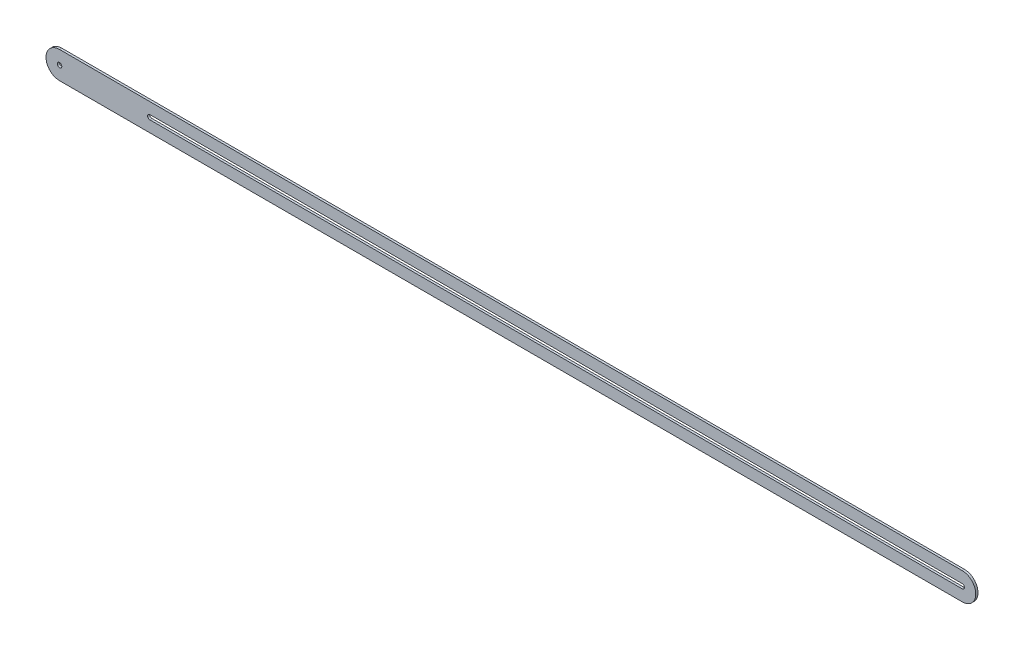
ISO-10303-21;
HEADER;
FILE_DESCRIPTION(('STEP AP214'),'2;1');
FILE_NAME('part.step','',(''),(''),'','','');
FILE_SCHEMA(('AUTOMOTIVE_DESIGN { 1 0 10303 214 1 1 1 1 }'));
ENDSEC;
DATA;
#1=APPLICATION_CONTEXT('core data for automotive mechanical design processes');
#2=APPLICATION_PROTOCOL_DEFINITION('international standard','automotive_design',2000,#1);
#3=PRODUCT_CONTEXT('',#1,'mechanical');
#4=PRODUCT('Part','Part','',(#3));
#5=PRODUCT_RELATED_PRODUCT_CATEGORY('part','',(#4));
#6=PRODUCT_DEFINITION_FORMATION('','',#4);
#7=PRODUCT_DEFINITION_CONTEXT('part definition',#1,'design');
#8=PRODUCT_DEFINITION('design','',#6,#7);
#9=PRODUCT_DEFINITION_SHAPE('','',#8);
#10=(LENGTH_UNIT() NAMED_UNIT(*) SI_UNIT(.MILLI.,.METRE.));
#11=(NAMED_UNIT(*) PLANE_ANGLE_UNIT() SI_UNIT($,.RADIAN.));
#12=(NAMED_UNIT(*) SI_UNIT($,.STERADIAN.) SOLID_ANGLE_UNIT());
#13=UNCERTAINTY_MEASURE_WITH_UNIT(LENGTH_MEASURE(1.E-05),#10,'distance_accuracy_value','');
#14=(GEOMETRIC_REPRESENTATION_CONTEXT(3) GLOBAL_UNCERTAINTY_ASSIGNED_CONTEXT((#13)) GLOBAL_UNIT_ASSIGNED_CONTEXT((#10,
#11,#12)) REPRESENTATION_CONTEXT('',''));
#15=CARTESIAN_POINT('',(0.,0.,0.));
#16=DIRECTION('',(0.,0.,1.));
#17=DIRECTION('',(1.,0.,0.));
#18=AXIS2_PLACEMENT_3D('',#15,#16,#17);
#19=CARTESIAN_POINT('',(0.,0.,1.));
#20=DIRECTION('',(0.,0.,1.));
#21=DIRECTION('',(1.,0.,0.));
#22=AXIS2_PLACEMENT_3D('',#19,#20,#21);
#23=PLANE('',#22);
#24=CARTESIAN_POINT('',(0.,0.,1.));
#25=DIRECTION('',(0.,0.,1.));
#26=DIRECTION('',(1.,0.,0.));
#27=AXIS2_PLACEMENT_3D('',#24,#25,#26);
#28=CIRCLE('',#27,6.);
#29=CARTESIAN_POINT('',(0.,6.,1.));
#30=VERTEX_POINT('',#29);
#31=CARTESIAN_POINT('',(0.,-6.,1.));
#32=VERTEX_POINT('',#31);
#33=EDGE_CURVE('E167',#30,#32,#28,.T.);
#34=ORIENTED_EDGE('',*,*,#33,.T.);
#35=DIRECTION('',(1.,0.,0.));
#36=VECTOR('',#35,1.);
#37=CARTESIAN_POINT('',(0.,-6.,1.));
#38=LINE('',#37,#36);
#39=CARTESIAN_POINT('',(400.,-5.99999999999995,1.));
#40=VERTEX_POINT('',#39);
#41=EDGE_CURVE('E171',#32,#40,#38,.T.);
#42=ORIENTED_EDGE('',*,*,#41,.T.);
#43=CARTESIAN_POINT('',(400.,0.,1.));
#44=DIRECTION('',(0.,0.,1.));
#45=DIRECTION('',(1.,0.,0.));
#46=AXIS2_PLACEMENT_3D('',#43,#44,#45);
#47=CIRCLE('',#46,6.);
#48=CARTESIAN_POINT('',(400.,6.,1.));
#49=VERTEX_POINT('',#48);
#50=EDGE_CURVE('E175',#40,#49,#47,.T.);
#51=ORIENTED_EDGE('',*,*,#50,.T.);
#52=DIRECTION('',(-1.,0.,0.));
#53=VECTOR('',#52,1.);
#54=CARTESIAN_POINT('',(0.,6.,1.));
#55=LINE('',#54,#53);
#56=EDGE_CURVE('E178',#49,#30,#55,.T.);
#57=ORIENTED_EDGE('',*,*,#56,.T.);
#58=EDGE_LOOP('',(#34,#42,#51,#57));
#59=FACE_BOUND('',#58,.T.);
#60=CARTESIAN_POINT('',(0.,0.,1.));
#61=DIRECTION('',(0.,0.,1.));
#62=DIRECTION('',(1.,0.,0.));
#63=AXIS2_PLACEMENT_3D('',#60,#61,#62);
#64=CIRCLE('',#63,1.);
#65=CARTESIAN_POINT('',(1.,0.,1.));
#66=VERTEX_POINT('',#65);
#67=EDGE_CURVE('E159',#66,#66,#64,.T.);
#68=ORIENTED_EDGE('',*,*,#67,.F.);
#69=EDGE_LOOP('',(#68));
#70=FACE_BOUND('',#69,.T.);
#71=DIRECTION('',(1.,0.,0.));
#72=VECTOR('',#71,1.);
#73=CARTESIAN_POINT('',(40.,-0.999999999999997,1.));
#74=LINE('',#73,#72);
#75=CARTESIAN_POINT('',(40.,-0.999999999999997,1.));
#76=VERTEX_POINT('',#75);
#77=CARTESIAN_POINT('',(400.,-0.999999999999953,1.));
#78=VERTEX_POINT('',#77);
#79=EDGE_CURVE('E120',#76,#78,#74,.T.);
#80=ORIENTED_EDGE('',*,*,#79,.F.);
#81=CARTESIAN_POINT('',(40.,0.,1.));
#82=DIRECTION('',(0.,0.,1.));
#83=DIRECTION('',(1.,0.,0.));
#84=AXIS2_PLACEMENT_3D('',#81,#82,#83);
#85=CIRCLE('',#84,1.);
#86=CARTESIAN_POINT('',(40.,1.,1.));
#87=VERTEX_POINT('',#86);
#88=EDGE_CURVE('E111',#87,#76,#85,.T.);
#89=ORIENTED_EDGE('',*,*,#88,.F.);
#90=DIRECTION('',(-1.,0.,0.));
#91=VECTOR('',#90,1.);
#92=CARTESIAN_POINT('',(40.,1.,1.));
#93=LINE('',#92,#91);
#94=CARTESIAN_POINT('',(400.,1.00000000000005,1.));
#95=VERTEX_POINT('',#94);
#96=EDGE_CURVE('E137',#95,#87,#93,.T.);
#97=ORIENTED_EDGE('',*,*,#96,.F.);
#98=CARTESIAN_POINT('',(400.,0.,1.));
#99=DIRECTION('',(0.,0.,1.));
#100=DIRECTION('',(1.,0.,0.));
#101=AXIS2_PLACEMENT_3D('',#98,#99,#100);
#102=CIRCLE('',#101,1.);
#103=EDGE_CURVE('E133',#78,#95,#102,.T.);
#104=ORIENTED_EDGE('',*,*,#103,.F.);
#105=EDGE_LOOP('',(#80,#89,#97,#104));
#106=FACE_BOUND('',#105,.T.);
#107=ADVANCED_FACE('F45',(#59,#70,#106),#23,.T.);
#108=CARTESIAN_POINT('',(0.,0.,0.));
#109=DIRECTION('',(0.,0.,1.));
#110=DIRECTION('',(1.,0.,0.));
#111=AXIS2_PLACEMENT_3D('',#108,#109,#110);
#112=PLANE('',#111);
#113=CARTESIAN_POINT('',(0.,0.,0.));
#114=DIRECTION('',(0.,0.,1.));
#115=DIRECTION('',(1.,0.,0.));
#116=AXIS2_PLACEMENT_3D('',#113,#114,#115);
#117=CIRCLE('',#116,1.);
#118=CARTESIAN_POINT('',(1.,0.,0.));
#119=VERTEX_POINT('',#118);
#120=EDGE_CURVE('E129',#119,#119,#117,.T.);
#121=ORIENTED_EDGE('',*,*,#120,.T.);
#122=EDGE_LOOP('',(#121));
#123=FACE_BOUND('',#122,.T.);
#124=CARTESIAN_POINT('',(0.,0.,0.));
#125=DIRECTION('',(0.,0.,1.));
#126=DIRECTION('',(1.,0.,0.));
#127=AXIS2_PLACEMENT_3D('',#124,#125,#126);
#128=CIRCLE('',#127,6.);
#129=CARTESIAN_POINT('',(0.,6.,0.));
#130=VERTEX_POINT('',#129);
#131=CARTESIAN_POINT('',(0.,-6.,0.));
#132=VERTEX_POINT('',#131);
#133=EDGE_CURVE('E163',#130,#132,#128,.T.);
#134=ORIENTED_EDGE('',*,*,#133,.F.);
#135=DIRECTION('',(-1.,0.,0.));
#136=VECTOR('',#135,1.);
#137=CARTESIAN_POINT('',(0.,6.,0.));
#138=LINE('',#137,#136);
#139=CARTESIAN_POINT('',(400.,6.,0.));
#140=VERTEX_POINT('',#139);
#141=EDGE_CURVE('E172',#140,#130,#138,.T.);
#142=ORIENTED_EDGE('',*,*,#141,.F.);
#143=CARTESIAN_POINT('',(400.,0.,0.));
#144=DIRECTION('',(0.,0.,1.));
#145=DIRECTION('',(1.,0.,0.));
#146=AXIS2_PLACEMENT_3D('',#143,#144,#145);
#147=CIRCLE('',#146,6.);
#148=CARTESIAN_POINT('',(400.,-5.99999999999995,0.));
#149=VERTEX_POINT('',#148);
#150=EDGE_CURVE('E188',#149,#140,#147,.T.);
#151=ORIENTED_EDGE('',*,*,#150,.F.);
#152=DIRECTION('',(1.,0.,0.));
#153=VECTOR('',#152,1.);
#154=CARTESIAN_POINT('',(0.,-6.,0.));
#155=LINE('',#154,#153);
#156=EDGE_CURVE('E185',#132,#149,#155,.T.);
#157=ORIENTED_EDGE('',*,*,#156,.F.);
#158=EDGE_LOOP('',(#134,#142,#151,#157));
#159=FACE_BOUND('',#158,.T.);
#160=CARTESIAN_POINT('',(40.,0.,0.));
#161=DIRECTION('',(0.,0.,1.));
#162=DIRECTION('',(1.,0.,0.));
#163=AXIS2_PLACEMENT_3D('',#160,#161,#162);
#164=CIRCLE('',#163,1.);
#165=CARTESIAN_POINT('',(40.,1.,0.));
#166=VERTEX_POINT('',#165);
#167=CARTESIAN_POINT('',(40.,-0.999999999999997,0.));
#168=VERTEX_POINT('',#167);
#169=EDGE_CURVE('E69',#166,#168,#164,.T.);
#170=ORIENTED_EDGE('',*,*,#169,.T.);
#171=DIRECTION('',(1.,0.,0.));
#172=VECTOR('',#171,1.);
#173=CARTESIAN_POINT('',(40.,-0.999999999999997,0.));
#174=LINE('',#173,#172);
#175=CARTESIAN_POINT('',(400.,-0.999999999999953,0.));
#176=VERTEX_POINT('',#175);
#177=EDGE_CURVE('E127',#168,#176,#174,.T.);
#178=ORIENTED_EDGE('',*,*,#177,.T.);
#179=CARTESIAN_POINT('',(400.,0.,0.));
#180=DIRECTION('',(0.,0.,1.));
#181=DIRECTION('',(1.,0.,0.));
#182=AXIS2_PLACEMENT_3D('',#179,#180,#181);
#183=CIRCLE('',#182,1.);
#184=CARTESIAN_POINT('',(400.,1.00000000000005,0.));
#185=VERTEX_POINT('',#184);
#186=EDGE_CURVE('E146',#176,#185,#183,.T.);
#187=ORIENTED_EDGE('',*,*,#186,.T.);
#188=DIRECTION('',(-1.,0.,0.));
#189=VECTOR('',#188,1.);
#190=CARTESIAN_POINT('',(40.,1.,0.));
#191=LINE('',#190,#189);
#192=EDGE_CURVE('E121',#185,#166,#191,.T.);
#193=ORIENTED_EDGE('',*,*,#192,.T.);
#194=EDGE_LOOP('',(#170,#178,#187,#193));
#195=FACE_BOUND('',#194,.T.);
#196=ADVANCED_FACE('F211',(#123,#159,#195),#112,.F.);
#197=CARTESIAN_POINT('',(0.,0.,1.));
#198=DIRECTION('',(0.,0.,-1.));
#199=DIRECTION('',(-1.,0.,0.));
#200=AXIS2_PLACEMENT_3D('',#197,#198,#199);
#201=CYLINDRICAL_SURFACE('',#200,6.);
#202=ORIENTED_EDGE('',*,*,#133,.T.);
#203=DIRECTION('',(0.,0.,-1.));
#204=VECTOR('',#203,1.);
#205=CARTESIAN_POINT('',(0.,-6.,1.));
#206=LINE('',#205,#204);
#207=EDGE_CURVE('E11',#32,#132,#206,.T.);
#208=ORIENTED_EDGE('',*,*,#207,.F.);
#209=ORIENTED_EDGE('',*,*,#33,.F.);
#210=DIRECTION('',(0.,0.,-1.));
#211=VECTOR('',#210,1.);
#212=CARTESIAN_POINT('',(0.,6.,1.));
#213=LINE('',#212,#211);
#214=EDGE_CURVE('E181',#30,#130,#213,.T.);
#215=ORIENTED_EDGE('',*,*,#214,.T.);
#216=EDGE_LOOP('',(#202,#208,#209,#215));
#217=FACE_BOUND('',#216,.T.);
#218=ADVANCED_FACE('F47',(#217),#201,.T.);
#219=CARTESIAN_POINT('',(0.,-6.,1.));
#220=DIRECTION('',(0.,1.,0.));
#221=DIRECTION('',(0.,0.,1.));
#222=AXIS2_PLACEMENT_3D('',#219,#220,#221);
#223=PLANE('',#222);
#224=ORIENTED_EDGE('',*,*,#156,.T.);
#225=DIRECTION('',(0.,0.,-1.));
#226=VECTOR('',#225,1.);
#227=CARTESIAN_POINT('',(400.,-5.99999999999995,1.));
#228=LINE('',#227,#226);
#229=EDGE_CURVE('E54',#40,#149,#228,.T.);
#230=ORIENTED_EDGE('',*,*,#229,.F.);
#231=ORIENTED_EDGE('',*,*,#41,.F.);
#232=ORIENTED_EDGE('',*,*,#207,.T.);
#233=EDGE_LOOP('',(#224,#230,#231,#232));
#234=FACE_BOUND('',#233,.T.);
#235=ADVANCED_FACE('F222',(#234),#223,.F.);
#236=CARTESIAN_POINT('',(400.,0.,1.));
#237=DIRECTION('',(0.,0.,-1.));
#238=DIRECTION('',(-1.,0.,0.));
#239=AXIS2_PLACEMENT_3D('',#236,#237,#238);
#240=CYLINDRICAL_SURFACE('',#239,6.);
#241=ORIENTED_EDGE('',*,*,#150,.T.);
#242=DIRECTION('',(0.,0.,-1.));
#243=VECTOR('',#242,1.);
#244=CARTESIAN_POINT('',(400.,6.,1.));
#245=LINE('',#244,#243);
#246=EDGE_CURVE('E196',#49,#140,#245,.T.);
#247=ORIENTED_EDGE('',*,*,#246,.F.);
#248=ORIENTED_EDGE('',*,*,#50,.F.);
#249=ORIENTED_EDGE('',*,*,#229,.T.);
#250=EDGE_LOOP('',(#241,#247,#248,#249));
#251=FACE_BOUND('',#250,.T.);
#252=ADVANCED_FACE('F205',(#251),#240,.T.);
#253=CARTESIAN_POINT('',(0.,6.,1.));
#254=DIRECTION('',(0.,-1.,0.));
#255=DIRECTION('',(0.,0.,-1.));
#256=AXIS2_PLACEMENT_3D('',#253,#254,#255);
#257=PLANE('',#256);
#258=ORIENTED_EDGE('',*,*,#141,.T.);
#259=ORIENTED_EDGE('',*,*,#214,.F.);
#260=ORIENTED_EDGE('',*,*,#56,.F.);
#261=ORIENTED_EDGE('',*,*,#246,.T.);
#262=EDGE_LOOP('',(#258,#259,#260,#261));
#263=FACE_BOUND('',#262,.T.);
#264=ADVANCED_FACE('F215',(#263),#257,.F.);
#265=CARTESIAN_POINT('',(0.,0.,1.));
#266=DIRECTION('',(0.,0.,-1.));
#267=DIRECTION('',(-1.,0.,0.));
#268=AXIS2_PLACEMENT_3D('',#265,#266,#267);
#269=CYLINDRICAL_SURFACE('',#268,1.);
#270=ORIENTED_EDGE('',*,*,#67,.T.);
#271=EDGE_LOOP('',(#270));
#272=FACE_BOUND('',#271,.T.);
#273=ORIENTED_EDGE('',*,*,#120,.F.);
#274=EDGE_LOOP('',(#273));
#275=FACE_BOUND('',#274,.T.);
#276=ADVANCED_FACE('F237',(#272,#275),#269,.F.);
#277=CARTESIAN_POINT('',(40.,0.,1.));
#278=DIRECTION('',(0.,0.,-1.));
#279=DIRECTION('',(-1.,0.,0.));
#280=AXIS2_PLACEMENT_3D('',#277,#278,#279);
#281=CYLINDRICAL_SURFACE('',#280,1.);
#282=ORIENTED_EDGE('',*,*,#169,.F.);
#283=DIRECTION('',(0.,0.,-1.));
#284=VECTOR('',#283,1.);
#285=CARTESIAN_POINT('',(40.,1.,1.));
#286=LINE('',#285,#284);
#287=EDGE_CURVE('E115',#87,#166,#286,.T.);
#288=ORIENTED_EDGE('',*,*,#287,.F.);
#289=ORIENTED_EDGE('',*,*,#88,.T.);
#290=DIRECTION('',(0.,0.,-1.));
#291=VECTOR('',#290,1.);
#292=CARTESIAN_POINT('',(40.,-0.999999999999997,1.));
#293=LINE('',#292,#291);
#294=EDGE_CURVE('E114',#76,#168,#293,.T.);
#295=ORIENTED_EDGE('',*,*,#294,.T.);
#296=EDGE_LOOP('',(#282,#288,#289,#295));
#297=FACE_BOUND('',#296,.T.);
#298=ADVANCED_FACE('F113',(#297),#281,.F.);
#299=CARTESIAN_POINT('',(40.,-0.999999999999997,1.));
#300=DIRECTION('',(0.,1.,0.));
#301=DIRECTION('',(-1.,0.,0.));
#302=AXIS2_PLACEMENT_3D('',#299,#300,#301);
#303=PLANE('',#302);
#304=ORIENTED_EDGE('',*,*,#177,.F.);
#305=ORIENTED_EDGE('',*,*,#294,.F.);
#306=ORIENTED_EDGE('',*,*,#79,.T.);
#307=DIRECTION('',(0.,0.,-1.));
#308=VECTOR('',#307,1.);
#309=CARTESIAN_POINT('',(400.,-0.999999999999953,1.));
#310=LINE('',#309,#308);
#311=EDGE_CURVE('E130',#78,#176,#310,.T.);
#312=ORIENTED_EDGE('',*,*,#311,.T.);
#313=EDGE_LOOP('',(#304,#305,#306,#312));
#314=FACE_BOUND('',#313,.T.);
#315=ADVANCED_FACE('F124',(#314),#303,.T.);
#316=CARTESIAN_POINT('',(400.,0.,1.));
#317=DIRECTION('',(0.,0.,-1.));
#318=DIRECTION('',(-1.,0.,0.));
#319=AXIS2_PLACEMENT_3D('',#316,#317,#318);
#320=CYLINDRICAL_SURFACE('',#319,1.);
#321=ORIENTED_EDGE('',*,*,#186,.F.);
#322=ORIENTED_EDGE('',*,*,#311,.F.);
#323=ORIENTED_EDGE('',*,*,#103,.T.);
#324=DIRECTION('',(0.,0.,-1.));
#325=VECTOR('',#324,1.);
#326=CARTESIAN_POINT('',(400.,1.00000000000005,1.));
#327=LINE('',#326,#325);
#328=EDGE_CURVE('E61',#95,#185,#327,.T.);
#329=ORIENTED_EDGE('',*,*,#328,.T.);
#330=EDGE_LOOP('',(#321,#322,#323,#329));
#331=FACE_BOUND('',#330,.T.);
#332=ADVANCED_FACE('F254',(#331),#320,.F.);
#333=CARTESIAN_POINT('',(40.,1.,1.));
#334=DIRECTION('',(0.,-1.,0.));
#335=DIRECTION('',(1.,0.,0.));
#336=AXIS2_PLACEMENT_3D('',#333,#334,#335);
#337=PLANE('',#336);
#338=ORIENTED_EDGE('',*,*,#192,.F.);
#339=ORIENTED_EDGE('',*,*,#328,.F.);
#340=ORIENTED_EDGE('',*,*,#96,.T.);
#341=ORIENTED_EDGE('',*,*,#287,.T.);
#342=EDGE_LOOP('',(#338,#339,#340,#341));
#343=FACE_BOUND('',#342,.T.);
#344=ADVANCED_FACE('F259',(#343),#337,.T.);
#345=CLOSED_SHELL('',(#107,#196,#218,#235,#252,#264,#276,#298,#315,#332,#344));
#346=MANIFOLD_SOLID_BREP('B2',#345);
#347=ADVANCED_BREP_SHAPE_REPRESENTATION('',(#18,#346),#14);
#348=SHAPE_DEFINITION_REPRESENTATION(#9,#347);
ENDSEC;
END-ISO-10303-21;
